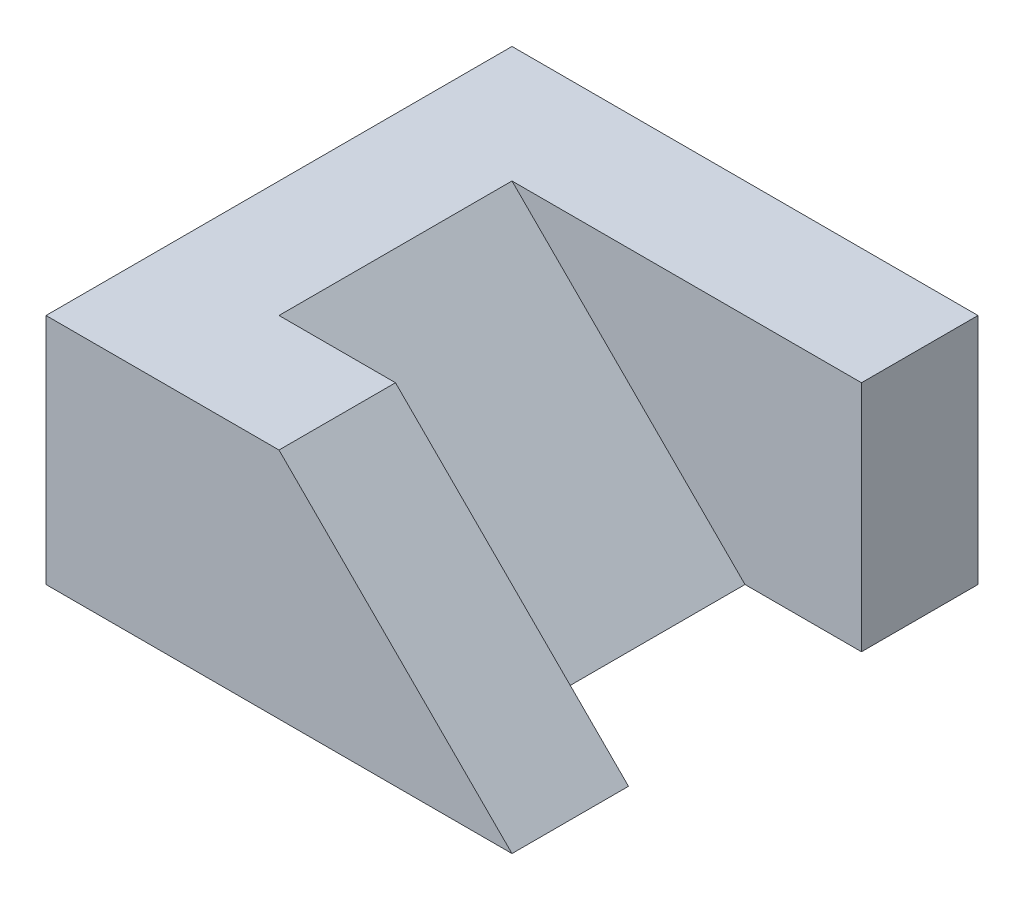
from build123d import *

# Parameters (mm, degrees)
EXTRUDE1_DEPTH = 10
EXTRUDE2_DEPTH = 10
SKETCH4_W      = 40
SKETCH4_H      = 20
EXTRUDE3_DEPTH = 10


with BuildPart() as part:
    # Sketch2 → Extrude1 (new, symmetric)
    with BuildSketch(Plane(origin=(0, 0, 0), x_dir=(1, 0, 0), z_dir=(0, 0, -1))):
        Polygon((0, 0), (30, 0), (10, -20), (0, -20), align=None)
    extrude(amount=EXTRUDE1_DEPTH, both=True)

    # Sketch3 → Extrude2 (add)
    with BuildSketch(Plane.XY.offset(10)):
        Polygon((0, 0), (40, 0), (20, 20), (0, 20), align=None)
    extrude(amount=EXTRUDE2_DEPTH)

    # Sketch4 → Extrude3 (add)
    with BuildSketch(Plane(origin=(0, 0, -10), x_dir=(-1, 0, 0), z_dir=(0, 0, -1))):
        with Locations((-20, 10)):
            Rectangle(SKETCH4_W, SKETCH4_H)
    extrude(amount=EXTRUDE3_DEPTH)


solid = part.part
